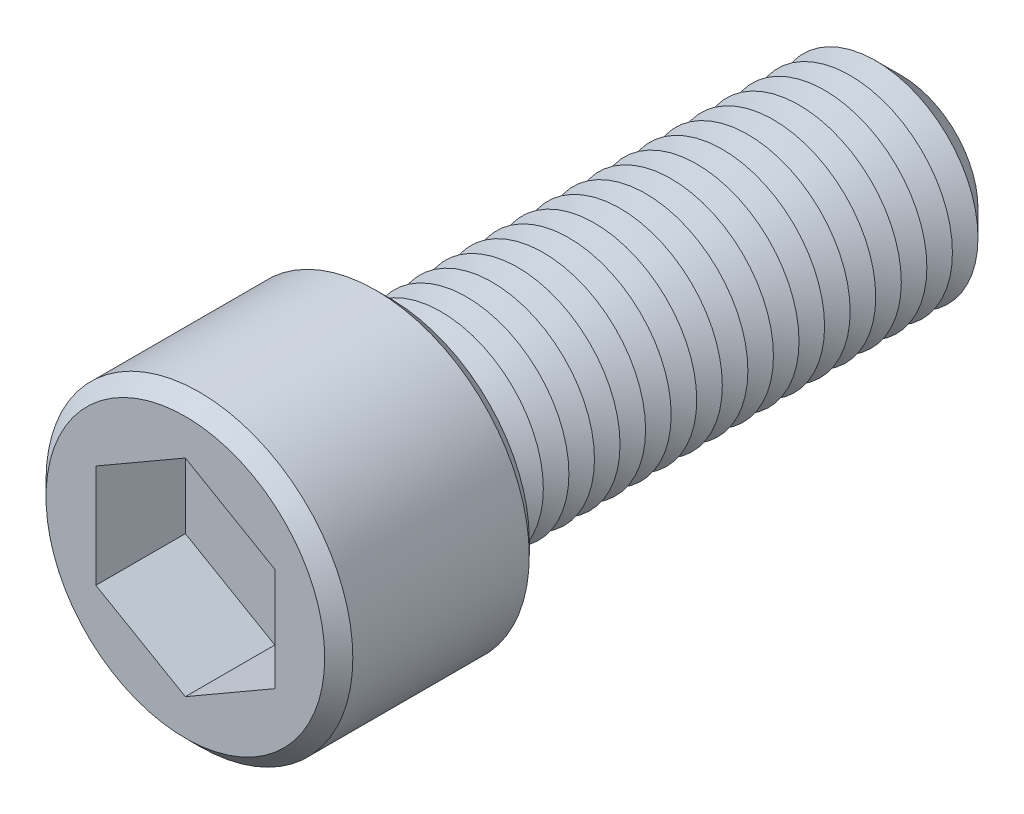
from build123d import *

# Parameters (mm, degrees)
SKETCH1_R           = 12
BOSS_EXTRUDE1_DEPTH = 16
SKETCH2_R           = 8
BOSS_EXTRUDE2_DEPTH = 40
CHAMFER1_SIZE       = 2
LPATTERN1_COUNT     = 19
LPATTERN1_PITCH     = 2
CUT_EXTRUDE1_DEPTH  = 7
SKETCH6_R           = 0.9
CUT_EXTRUDE2_DEPTH  = 49
CHAMFER2_SIZE       = 1.1


with BuildPart() as part:
    # Sketch1 → Boss-Extrude1 (new body)
    with BuildSketch(Plane.XY):
        Circle(SKETCH1_R)
    extrude(amount=BOSS_EXTRUDE1_DEPTH)

    # Sketch2 → Boss-Extrude2 (add)
    with BuildSketch(Plane(origin=(0, 0, 0), x_dir=(-1, 0, 0), z_dir=(0, 0, -1))):
        Circle(SKETCH2_R)
    extrude(amount=BOSS_EXTRUDE2_DEPTH)

    # Chamfer1
    chamfer1_edges = [part.edges().sort_by_distance(p)[0] for p in [
        (8, 0, -40),
    ]]
    chamfer(chamfer1_edges, length=CHAMFER1_SIZE)

    # Sketch4 → Cut-Revolve1 (revolve, cut)
    with BuildSketch(Plane(origin=(0, 0, 0), x_dir=(0, 0, -1), z_dir=(1, 0, 0)), mode=Mode.PRIVATE) as cut_revolve1_sk:
        Polygon((0, 8), (1, 6.267949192), (2, 8), align=None)
    cut_revolve1 = revolve(cut_revolve1_sk.sketch.rotate(Axis((0, 0, 2.512122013), (0, 0, -1)), 90), axis=Axis((0, 0, 2.512122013), (0, 0, -1)), mode=Mode.SUBTRACT)

    # LPattern1: Cut-Revolve1 ×19
    with Locations(*[(0, 0, -i * LPATTERN1_PITCH) for i in range(1, LPATTERN1_COUNT)]):
        add(cut_revolve1, mode=Mode.SUBTRACT)

    # Sketch5 → Cut-Extrude1 (cut)
    with BuildSketch(Plane.XY.offset(16)):
        Polygon((0, 8.082903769), (-7, 4.041451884), (-7, -4.041451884), (0, -8.082903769), (7, -4.041451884), (7, 4.041451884), align=None)
    extrude(amount=-CUT_EXTRUDE1_DEPTH, mode=Mode.SUBTRACT)

    # Sketch6 → Cut-Extrude2 (cut)
    with BuildSketch(Plane.XY.offset(9)):
        Circle(SKETCH6_R)
    extrude(amount=-CUT_EXTRUDE2_DEPTH, mode=Mode.SUBTRACT)

    # Chamfer2
    chamfer2_edges = [part.edges().sort_by_distance(p)[0] for p in [
        (-12, 0, 0),
        (-12, 0, 16),
    ]]
    chamfer(chamfer2_edges, length=CHAMFER2_SIZE)


solid = part.part
